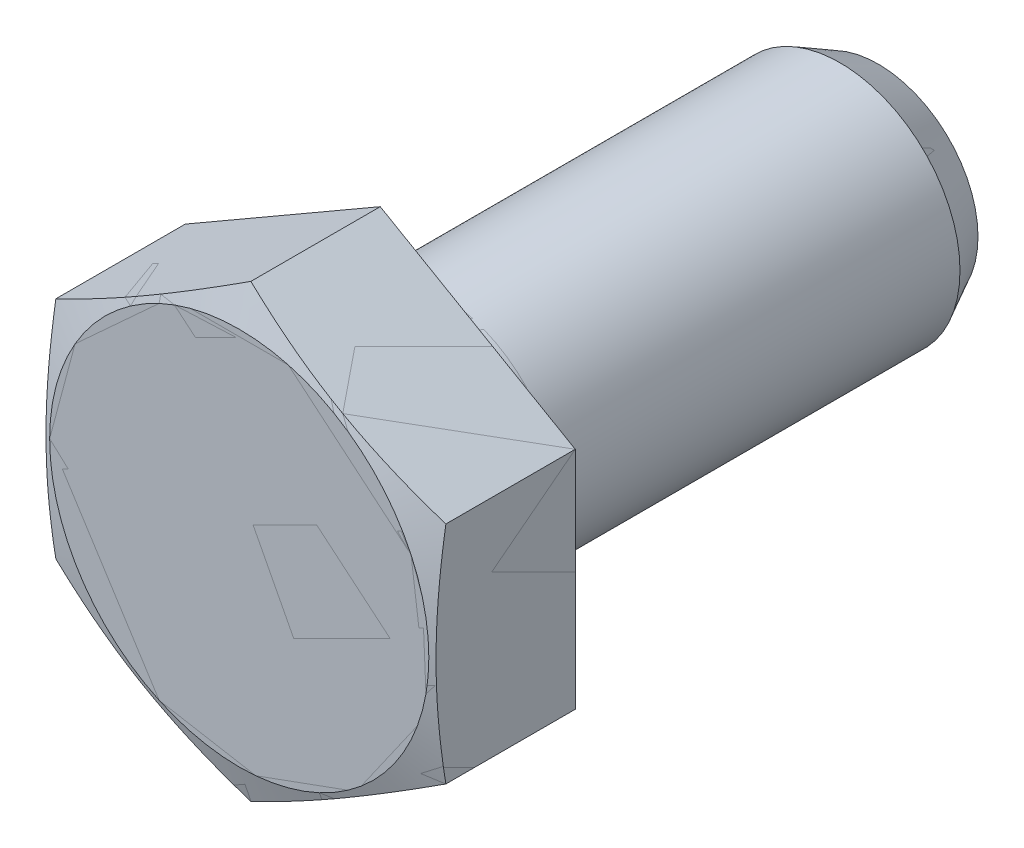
ISO-10303-21;
HEADER;
FILE_DESCRIPTION(('STEP AP214'),'2;1');
FILE_NAME('part.step','',(''),(''),'','','');
FILE_SCHEMA(('AUTOMOTIVE_DESIGN { 1 0 10303 214 1 1 1 1 }'));
ENDSEC;
DATA;
#1=APPLICATION_CONTEXT('core data for automotive mechanical design processes');
#2=APPLICATION_PROTOCOL_DEFINITION('international standard','automotive_design',2000,#1);
#3=PRODUCT_CONTEXT('',#1,'mechanical');
#4=PRODUCT('Part','Part','',(#3));
#5=PRODUCT_RELATED_PRODUCT_CATEGORY('part','',(#4));
#6=PRODUCT_DEFINITION_FORMATION('','',#4);
#7=PRODUCT_DEFINITION_CONTEXT('part definition',#1,'design');
#8=PRODUCT_DEFINITION('design','',#6,#7);
#9=PRODUCT_DEFINITION_SHAPE('','',#8);
#10=(LENGTH_UNIT() NAMED_UNIT(*) SI_UNIT(.MILLI.,.METRE.));
#11=(NAMED_UNIT(*) PLANE_ANGLE_UNIT() SI_UNIT($,.RADIAN.));
#12=(NAMED_UNIT(*) SI_UNIT($,.STERADIAN.) SOLID_ANGLE_UNIT());
#13=UNCERTAINTY_MEASURE_WITH_UNIT(LENGTH_MEASURE(1.E-05),#10,'distance_accuracy_value','');
#14=(GEOMETRIC_REPRESENTATION_CONTEXT(3) GLOBAL_UNCERTAINTY_ASSIGNED_CONTEXT((#13)) GLOBAL_UNIT_ASSIGNED_CONTEXT((#10,
#11,#12)) REPRESENTATION_CONTEXT('',''));
#15=CARTESIAN_POINT('',(0.,0.,0.));
#16=DIRECTION('',(0.,0.,1.));
#17=DIRECTION('',(1.,0.,0.));
#18=AXIS2_PLACEMENT_3D('',#15,#16,#17);
#19=CARTESIAN_POINT('',(0.,0.,0.6));
#20=DIRECTION('',(0.,0.,1.));
#21=DIRECTION('',(1.,0.,0.));
#22=AXIS2_PLACEMENT_3D('',#19,#20,#21);
#23=TOROIDAL_SURFACE('',#22,5.1,0.6);
#24=CARTESIAN_POINT('',(0.,0.,0.6));
#25=DIRECTION('',(0.,0.,1.));
#26=DIRECTION('',(1.,0.,0.));
#27=AXIS2_PLACEMENT_3D('',#24,#25,#26);
#28=CIRCLE('',#27,5.7);
#29=CARTESIAN_POINT('',(5.7,0.,0.6));
#30=VERTEX_POINT('',#29);
#31=EDGE_CURVE('P0_E11',#30,#30,#28,.T.);
#32=ORIENTED_EDGE('',*,*,#31,.F.);
#33=EDGE_LOOP('',(#32));
#34=FACE_BOUND('',#33,.T.);
#35=CARTESIAN_POINT('',(0.,0.,0.));
#36=DIRECTION('',(0.,0.,1.));
#37=DIRECTION('',(1.,0.,0.));
#38=AXIS2_PLACEMENT_3D('',#35,#36,#37);
#39=CIRCLE('',#38,5.1);
#40=CARTESIAN_POINT('',(5.1,0.,0.));
#41=VERTEX_POINT('',#40);
#42=EDGE_CURVE('P0_E33',#41,#41,#39,.T.);
#43=ORIENTED_EDGE('',*,*,#42,.T.);
#44=EDGE_LOOP('',(#43));
#45=FACE_BOUND('',#44,.T.);
#46=ADVANCED_FACE('P0_F26',(#34,#45),#23,.T.);
#47=CARTESIAN_POINT('',(0.,5.1,0.));
#48=DIRECTION('',(0.,0.,-1.));
#49=DIRECTION('',(-1.,0.,0.));
#50=AXIS2_PLACEMENT_3D('',#47,#48,#49);
#51=PLANE('',#50);
#52=CARTESIAN_POINT('',(0.,0.,0.));
#53=DIRECTION('',(0.,0.,1.));
#54=DIRECTION('',(1.,0.,0.));
#55=AXIS2_PLACEMENT_3D('',#52,#53,#54);
#56=CIRCLE('',#55,4.4);
#57=CARTESIAN_POINT('',(4.4,0.,0.));
#58=VERTEX_POINT('',#57);
#59=EDGE_CURVE('P0_E118',#58,#58,#56,.T.);
#60=ORIENTED_EDGE('',*,*,#59,.T.);
#61=EDGE_LOOP('',(#60));
#62=FACE_BOUND('',#61,.T.);
#63=ORIENTED_EDGE('',*,*,#42,.F.);
#64=EDGE_LOOP('',(#63));
#65=FACE_BOUND('',#64,.T.);
#66=ADVANCED_FACE('P0_F124',(#62,#65),#51,.T.);
#67=CARTESIAN_POINT('',(0.,0.,-0.4));
#68=DIRECTION('',(0.,0.,1.));
#69=DIRECTION('',(1.,0.,0.));
#70=AXIS2_PLACEMENT_3D('',#67,#68,#69);
#71=TOROIDAL_SURFACE('',#70,4.4,0.4);
#72=CARTESIAN_POINT('',(0.,0.,-0.4));
#73=DIRECTION('',(0.,0.,1.));
#74=DIRECTION('',(1.,0.,0.));
#75=AXIS2_PLACEMENT_3D('',#72,#73,#74);
#76=CIRCLE('',#75,4.);
#77=CARTESIAN_POINT('',(4.,0.,-0.4));
#78=VERTEX_POINT('',#77);
#79=EDGE_CURVE('P0_E115',#78,#78,#76,.T.);
#80=ORIENTED_EDGE('',*,*,#79,.T.);
#81=EDGE_LOOP('',(#80));
#82=FACE_BOUND('',#81,.T.);
#83=ORIENTED_EDGE('',*,*,#59,.F.);
#84=EDGE_LOOP('',(#83));
#85=FACE_BOUND('',#84,.T.);
#86=ADVANCED_FACE('P0_F126',(#82,#85),#71,.F.);
#87=CARTESIAN_POINT('',(-6.5,-3.752775,0.6));
#88=DIRECTION('',(0.,0.,-1.));
#89=DIRECTION('',(-1.,0.,0.));
#90=AXIS2_PLACEMENT_3D('',#87,#88,#89);
#91=PLANE('',#90);
#92=DIRECTION('',(0.,-1.,0.));
#93=VECTOR('',#92,1.);
#94=CARTESIAN_POINT('',(-6.5,3.752775,0.6));
#95=LINE('',#94,#93);
#96=CARTESIAN_POINT('',(-6.5,3.752775,0.6));
#97=VERTEX_POINT('',#96);
#98=CARTESIAN_POINT('',(-6.5,-3.752775,0.6));
#99=VERTEX_POINT('',#98);
#100=EDGE_CURVE('P0_E92',#97,#99,#95,.T.);
#101=ORIENTED_EDGE('',*,*,#100,.F.);
#102=DIRECTION('',(0.866025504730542,0.499999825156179,0.));
#103=VECTOR('',#102,1.);
#104=CARTESIAN_POINT('',(-6.5,3.752775,0.6));
#105=LINE('',#104,#103);
#106=CARTESIAN_POINT('',(0.,7.50555,0.6));
#107=VERTEX_POINT('',#106);
#108=EDGE_CURVE('P0_E97',#97,#107,#105,.T.);
#109=ORIENTED_EDGE('',*,*,#108,.T.);
#110=DIRECTION('',(0.866025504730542,-0.499999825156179,0.));
#111=VECTOR('',#110,1.);
#112=CARTESIAN_POINT('',(0.,7.50555,0.6));
#113=LINE('',#112,#111);
#114=CARTESIAN_POINT('',(6.5,3.752775,0.6));
#115=VERTEX_POINT('',#114);
#116=EDGE_CURVE('P0_E103',#107,#115,#113,.T.);
#117=ORIENTED_EDGE('',*,*,#116,.T.);
#118=DIRECTION('',(0.,-1.,0.));
#119=VECTOR('',#118,1.);
#120=CARTESIAN_POINT('',(6.5,3.752775,0.6));
#121=LINE('',#120,#119);
#122=CARTESIAN_POINT('',(6.5,-3.752775,0.6));
#123=VERTEX_POINT('',#122);
#124=EDGE_CURVE('P0_E233',#115,#123,#121,.T.);
#125=ORIENTED_EDGE('',*,*,#124,.T.);
#126=DIRECTION('',(-0.866025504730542,-0.499999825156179,0.));
#127=VECTOR('',#126,1.);
#128=CARTESIAN_POINT('',(6.5,-3.752775,0.6));
#129=LINE('',#128,#127);
#130=CARTESIAN_POINT('',(0.,-7.50555,0.6));
#131=VERTEX_POINT('',#130);
#132=EDGE_CURVE('P0_E219',#123,#131,#129,.T.);
#133=ORIENTED_EDGE('',*,*,#132,.T.);
#134=DIRECTION('',(-0.866025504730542,0.499999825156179,0.));
#135=VECTOR('',#134,1.);
#136=CARTESIAN_POINT('',(0.,-7.50555,0.6));
#137=LINE('',#136,#135);
#138=EDGE_CURVE('P0_E217',#131,#99,#137,.T.);
#139=ORIENTED_EDGE('',*,*,#138,.T.);
#140=EDGE_LOOP('',(#101,#109,#117,#125,#133,#139));
#141=FACE_BOUND('',#140,.T.);
#142=ORIENTED_EDGE('',*,*,#31,.T.);
#143=EDGE_LOOP('',(#142));
#144=FACE_BOUND('',#143,.T.);
#145=ADVANCED_FACE('P0_F132',(#141,#144),#91,.T.);
#146=CARTESIAN_POINT('',(-6.5,3.752775,0.6));
#147=DIRECTION('',(-1.,0.,0.));
#148=DIRECTION('',(0.,0.,1.));
#149=AXIS2_PLACEMENT_3D('',#146,#147,#148);
#150=PLANE('',#149);
#151=CARTESIAN_POINT('',(-6.5,-9.92964867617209,3.49086478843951));
#152=CARTESIAN_POINT('',(-6.5,-9.63505499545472,3.5712065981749));
#153=CARTESIAN_POINT('',(-6.5,-9.34019533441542,3.65059082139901));
#154=CARTESIAN_POINT('',(-6.5,-8.74981084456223,3.80691915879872));
#155=CARTESIAN_POINT('',(-6.5,-8.45428597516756,3.88386311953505));
#156=CARTESIAN_POINT('',(-6.5,-7.86204294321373,4.03488590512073));
#157=CARTESIAN_POINT('',(-6.5,-7.56532366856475,4.10896038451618));
#158=CARTESIAN_POINT('',(-6.5,-6.97098572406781,4.2534063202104));
#159=CARTESIAN_POINT('',(-6.5,-6.6733670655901,4.32377782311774));
#160=CARTESIAN_POINT('',(-6.5,-6.08056173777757,4.45911797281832));
#161=CARTESIAN_POINT('',(-6.5,-5.78538736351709,4.52414020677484));
#162=CARTESIAN_POINT('',(-6.5,-5.19386217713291,4.64858264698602));
#163=CARTESIAN_POINT('',(-6.5,-4.89751140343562,4.70800303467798));
#164=CARTESIAN_POINT('',(-6.5,-4.30354427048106,4.81988242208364));
#165=CARTESIAN_POINT('',(-6.5,-4.0059281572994,4.87234271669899));
#166=CARTESIAN_POINT('',(-6.5,-3.40930063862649,4.96872328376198));
#167=CARTESIAN_POINT('',(-6.5,-3.11028923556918,5.01264357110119));
#168=CARTESIAN_POINT('',(-6.5,-2.51225701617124,5.0900277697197));
#169=CARTESIAN_POINT('',(-6.5,-2.21324222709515,5.12353758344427));
#170=CARTESIAN_POINT('',(-6.5,-1.61411183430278,5.17870354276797));
#171=CARTESIAN_POINT('',(-6.5,-1.3139962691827,5.20036010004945));
#172=CARTESIAN_POINT('',(-6.5,-0.713298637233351,5.23053172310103));
#173=CARTESIAN_POINT('',(-6.5,-0.412717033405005,5.23905581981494));
#174=CARTESIAN_POINT('',(-6.5,0.188524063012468,5.24243560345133));
#175=CARTESIAN_POINT('',(-6.5,0.489183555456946,5.2372913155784));
#176=CARTESIAN_POINT('',(-6.5,1.09152745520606,5.2136117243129));
#177=CARTESIAN_POINT('',(-6.5,1.3932090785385,5.19500703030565));
#178=CARTESIAN_POINT('',(-6.5,1.99554958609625,5.14547306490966));
#179=CARTESIAN_POINT('',(-6.5,2.29620843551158,5.11454337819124));
#180=CARTESIAN_POINT('',(-6.5,2.89650581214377,5.0419479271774));
#181=CARTESIAN_POINT('',(-6.5,3.19614304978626,5.00027166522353));
#182=CARTESIAN_POINT('',(-6.5,3.79401781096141,4.90795603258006));
#183=CARTESIAN_POINT('',(-6.5,4.09225532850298,4.85731662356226));
#184=CARTESIAN_POINT('',(-6.5,4.67104479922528,4.75169914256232));
#185=CARTESIAN_POINT('',(-6.5,4.95166879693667,4.69711189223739));
#186=CARTESIAN_POINT('',(-6.5,5.51183010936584,4.58259524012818));
#187=CARTESIAN_POINT('',(-6.5,5.79136737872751,4.52266561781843));
#188=CARTESIAN_POINT('',(-6.5,6.34950884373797,4.39845686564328));
#189=CARTESIAN_POINT('',(-6.5,6.62811290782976,4.3341771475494));
#190=CARTESIAN_POINT('',(-6.5,7.18448228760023,4.20207632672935));
#191=CARTESIAN_POINT('',(-6.5,7.46224758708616,4.13425515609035));
#192=CARTESIAN_POINT('',(-6.5,8.29465040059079,3.92644062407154));
#193=CARTESIAN_POINT('',(-6.5,8.84821091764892,3.78213813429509));
#194=CARTESIAN_POINT('',(-6.5,9.95318059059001,3.48578921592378));
#195=CARTESIAN_POINT('',(-6.5,10.5045899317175,3.33374347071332));
#196=CARTESIAN_POINT('',(-6.5,11.5983000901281,3.02633802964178));
#197=CARTESIAN_POINT('',(-6.5,12.1406218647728,2.87105268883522));
#198=CARTESIAN_POINT('',(-6.5,13.2241662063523,2.5566504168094));
#199=CARTESIAN_POINT('',(-6.5,13.7653887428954,2.39753338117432));
#200=CARTESIAN_POINT('',(-6.5,14.8460115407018,2.07676144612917));
#201=CARTESIAN_POINT('',(-6.5,15.3854133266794,1.91511167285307));
#202=CARTESIAN_POINT('',(-6.5,16.4635332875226,1.58964045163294));
#203=CARTESIAN_POINT('',(-6.5,17.0022514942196,1.42581910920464));
#204=CARTESIAN_POINT('',(-6.5,17.5407314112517,1.26122765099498));
#205=B_SPLINE_CURVE_WITH_KNOTS('',3,(#151,#152,#153,#154,#155,#156,#157,#158,#159,#160,#161,
#162,#163,#164,#165,#166,#167,#168,#169,#170,#171,#172,#173,#174,#175,#176,#177,#178,#179,#180,
#181,#182,#183,#184,#185,#186,#187,#188,#189,#190,#191,#192,#193,#194,#195,#196,#197,#198,#199,
#200,#201,#202,#203,#204),.UNSPECIFIED.,.F.,.F.,(4,2,2,2,2,2,2,2,2,2,2,2,2,2,2,2,2,2,2,2,2,2,2,
2,2,2,4),(0.,0.916063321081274,1.83218412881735,2.74964198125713,3.66708828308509,
4.57379877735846,5.4804798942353,6.38699208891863,7.29350270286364,8.19595761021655,
9.09838117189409,10.0001838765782,10.9019849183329,11.8084683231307,12.7149822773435,
13.6223851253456,14.5297918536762,15.3873818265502,16.2450072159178,17.102748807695,
17.9605068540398,19.676588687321,21.3925193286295,23.0848462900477,24.7772194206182,
26.4665232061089,28.1557452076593),.UNSPECIFIED.);
#206=CARTESIAN_POINT('',(-6.5,3.752775,4.91320410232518));
#207=VERTEX_POINT('',#206);
#208=CARTESIAN_POINT('',(-6.5,-3.752775,4.91320410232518));
#209=VERTEX_POINT('',#208);
#210=EDGE_CURVE('P0_E81',#207,#209,#205,.F.);
#211=ORIENTED_EDGE('',*,*,#210,.F.);
#212=DIRECTION('',(0.,0.,1.));
#213=VECTOR('',#212,1.);
#214=CARTESIAN_POINT('',(-6.5,3.752775,0.6));
#215=LINE('',#214,#213);
#216=EDGE_CURVE('P0_E90',#97,#207,#215,.T.);
#217=ORIENTED_EDGE('',*,*,#216,.F.);
#218=ORIENTED_EDGE('',*,*,#100,.T.);
#219=DIRECTION('',(0.,0.,1.));
#220=VECTOR('',#219,1.);
#221=CARTESIAN_POINT('',(-6.5,-3.752775,0.6));
#222=LINE('',#221,#220);
#223=EDGE_CURVE('P0_E48',#99,#209,#222,.T.);
#224=ORIENTED_EDGE('',*,*,#223,.T.);
#225=EDGE_LOOP('',(#211,#217,#218,#224));
#226=FACE_BOUND('',#225,.T.);
#227=ADVANCED_FACE('P0_F88',(#226),#150,.T.);
#228=CARTESIAN_POINT('',(0.,-7.50555,0.6));
#229=DIRECTION('',(0.499999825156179,0.866025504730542,0.));
#230=DIRECTION('',(0.866025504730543,-0.499999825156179,0.));
#231=AXIS2_PLACEMENT_3D('',#228,#229,#230);
#232=PLANE('',#231);
#233=DIRECTION('',(0.,0.,1.));
#234=VECTOR('',#233,1.);
#235=CARTESIAN_POINT('',(0.,-7.50555,0.6));
#236=LINE('',#235,#234);
#237=CARTESIAN_POINT('',(0.,-7.50555,4.91320495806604));
#238=VERTEX_POINT('',#237);
#239=EDGE_CURVE('P0_E224',#131,#238,#236,.T.);
#240=ORIENTED_EDGE('',*,*,#239,.T.);
#241=CARTESIAN_POINT('',(2.00000000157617E-07,-7.50555011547,4.91320492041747));
#242=CARTESIAN_POINT('',(-0.269500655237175,-7.34995379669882,4.96395435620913));
#243=CARTESIAN_POINT('',(-0.539719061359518,-7.19394319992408,5.01007955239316));
#244=CARTESIAN_POINT('',(-1.08156698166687,-6.88110730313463,5.09118099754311));
#245=CARTESIAN_POINT('',(-1.35319726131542,-6.72428156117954,5.12615037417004));
#246=CARTESIAN_POINT('',(-1.89544179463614,-6.41121667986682,5.1827563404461));
#247=CARTESIAN_POINT('',(-2.16604804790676,-6.25498215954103,5.2044923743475));
#248=CARTESIAN_POINT('',(-2.70776966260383,-5.94221918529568,5.23364290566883));
#249=CARTESIAN_POINT('',(-2.978884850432,-5.78569083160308,5.24106162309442));
#250=CARTESIAN_POINT('',(-3.52111522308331,-5.47263412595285,5.24106153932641));
#251=CARTESIAN_POINT('',(-3.79223040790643,-5.31610577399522,5.23364273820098));
#252=CARTESIAN_POINT('',(-4.33395201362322,-5.00334280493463,5.20449204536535));
#253=CARTESIAN_POINT('',(-4.60455826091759,-4.84710828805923,5.1827559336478));
#254=CARTESIAN_POINT('',(-5.14680278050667,-4.53404341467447,5.12614982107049));
#255=CARTESIAN_POINT('',(-5.41843305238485,-4.3772176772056,5.0911803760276));
#256=CARTESIAN_POINT('',(-5.96028095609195,-4.06438179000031,5.01007880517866));
#257=CARTESIAN_POINT('',(-6.23049935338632,-3.9083711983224,4.96395355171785));
#258=CARTESIAN_POINT('',(-6.5000002,-3.75277488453,4.91320406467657));
#259=B_SPLINE_CURVE_WITH_KNOTS('',3,(#241,#242,#243,#244,#245,#246,#247,#248,#249,#250,#251,
#252,#253,#254,#255,#256,#257,#258),.UNSPECIFIED.,.F.,.F.,(4,2,2,2,2,2,2,2,4),(0.,
0.945987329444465,1.89255629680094,2.83192136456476,3.77100951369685,4.71009765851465,
5.64946272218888,6.59603168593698,7.54201901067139),.UNSPECIFIED.);
#260=EDGE_CURVE('P0_E93',#238,#209,#259,.T.);
#261=ORIENTED_EDGE('',*,*,#260,.T.);
#262=ORIENTED_EDGE('',*,*,#223,.F.);
#263=ORIENTED_EDGE('',*,*,#138,.F.);
#264=EDGE_LOOP('',(#240,#261,#262,#263));
#265=FACE_BOUND('',#264,.T.);
#266=ADVANCED_FACE('P0_F153',(#265),#232,.F.);
#267=CARTESIAN_POINT('',(6.5,-3.752775,0.6));
#268=DIRECTION('',(-0.499999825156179,0.866025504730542,0.));
#269=DIRECTION('',(0.866025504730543,0.499999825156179,0.));
#270=AXIS2_PLACEMENT_3D('',#267,#268,#269);
#271=PLANE('',#270);
#272=DIRECTION('',(0.,0.,1.));
#273=VECTOR('',#272,1.);
#274=CARTESIAN_POINT('',(6.5,-3.752775,0.6));
#275=LINE('',#274,#273);
#276=CARTESIAN_POINT('',(6.5,-3.752775,4.91320410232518));
#277=VERTEX_POINT('',#276);
#278=EDGE_CURVE('P0_E227',#123,#277,#275,.T.);
#279=ORIENTED_EDGE('',*,*,#278,.T.);
#280=CARTESIAN_POINT('',(6.5000002,-3.75277488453,4.91320406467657));
#281=CARTESIAN_POINT('',(6.23049935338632,-3.90837119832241,4.96395355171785));
#282=CARTESIAN_POINT('',(5.96028095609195,-4.06438179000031,5.01007880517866));
#283=CARTESIAN_POINT('',(5.41843305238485,-4.37721767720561,5.0911803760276));
#284=CARTESIAN_POINT('',(5.14680278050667,-4.53404341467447,5.12614982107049));
#285=CARTESIAN_POINT('',(4.60455826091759,-4.84710828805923,5.1827559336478));
#286=CARTESIAN_POINT('',(4.33395201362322,-5.00334280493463,5.20449204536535));
#287=CARTESIAN_POINT('',(3.79223040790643,-5.31610577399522,5.23364273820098));
#288=CARTESIAN_POINT('',(3.52111522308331,-5.47263412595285,5.24106153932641));
#289=CARTESIAN_POINT('',(2.97888485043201,-5.78569083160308,5.24106162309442));
#290=CARTESIAN_POINT('',(2.70776966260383,-5.94221918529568,5.23364290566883));
#291=CARTESIAN_POINT('',(2.16604804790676,-6.25498215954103,5.20449237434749));
#292=CARTESIAN_POINT('',(1.89544179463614,-6.41121667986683,5.1827563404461));
#293=CARTESIAN_POINT('',(1.35319726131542,-6.72428156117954,5.12615037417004));
#294=CARTESIAN_POINT('',(1.08156698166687,-6.88110730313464,5.09118099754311));
#295=CARTESIAN_POINT('',(0.53971906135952,-7.19394319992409,5.01007955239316));
#296=CARTESIAN_POINT('',(0.269500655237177,-7.34995379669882,4.96395435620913));
#297=CARTESIAN_POINT('',(-1.99999999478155E-07,-7.50555011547,4.91320492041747));
#298=B_SPLINE_CURVE_WITH_KNOTS('',3,(#280,#281,#282,#283,#284,#285,#286,#287,#288,#289,#290,
#291,#292,#293,#294,#295,#296,#297),.UNSPECIFIED.,.F.,.F.,(4,2,2,2,2,2,2,2,4),(0.,
0.945987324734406,1.89255628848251,2.83192135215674,3.77100949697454,4.71009764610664,
5.64946271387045,6.59603168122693,7.54201901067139),.UNSPECIFIED.);
#299=EDGE_CURVE('P0_E190',#277,#238,#298,.T.);
#300=ORIENTED_EDGE('',*,*,#299,.T.);
#301=ORIENTED_EDGE('',*,*,#239,.F.);
#302=ORIENTED_EDGE('',*,*,#132,.F.);
#303=EDGE_LOOP('',(#279,#300,#301,#302));
#304=FACE_BOUND('',#303,.T.);
#305=ADVANCED_FACE('P0_F195',(#304),#271,.F.);
#306=CARTESIAN_POINT('',(6.5,3.752775,0.6));
#307=DIRECTION('',(-1.,0.,0.));
#308=DIRECTION('',(0.,0.,1.));
#309=AXIS2_PLACEMENT_3D('',#306,#307,#308);
#310=PLANE('',#309);
#311=DIRECTION('',(0.,0.,1.));
#312=VECTOR('',#311,1.);
#313=CARTESIAN_POINT('',(6.5,3.752775,0.6));
#314=LINE('',#313,#312);
#315=CARTESIAN_POINT('',(6.5,3.752775,4.91320410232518));
#316=VERTEX_POINT('',#315);
#317=EDGE_CURVE('P0_E101',#115,#316,#314,.T.);
#318=ORIENTED_EDGE('',*,*,#317,.T.);
#319=CARTESIAN_POINT('',(6.5,-9.92964867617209,3.49086478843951));
#320=CARTESIAN_POINT('',(6.5,-9.63505499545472,3.5712065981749));
#321=CARTESIAN_POINT('',(6.5,-9.34019533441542,3.65059082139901));
#322=CARTESIAN_POINT('',(6.5,-8.74981084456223,3.80691915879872));
#323=CARTESIAN_POINT('',(6.5,-8.45428597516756,3.88386311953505));
#324=CARTESIAN_POINT('',(6.5,-7.86204294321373,4.03488590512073));
#325=CARTESIAN_POINT('',(6.5,-7.56532366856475,4.10896038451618));
#326=CARTESIAN_POINT('',(6.5,-6.97098572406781,4.2534063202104));
#327=CARTESIAN_POINT('',(6.5,-6.6733670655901,4.32377782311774));
#328=CARTESIAN_POINT('',(6.5,-6.08056173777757,4.45911797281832));
#329=CARTESIAN_POINT('',(6.5,-5.78538736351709,4.52414020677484));
#330=CARTESIAN_POINT('',(6.5,-5.19386217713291,4.64858264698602));
#331=CARTESIAN_POINT('',(6.5,-4.89751140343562,4.70800303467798));
#332=CARTESIAN_POINT('',(6.5,-4.30354427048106,4.81988242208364));
#333=CARTESIAN_POINT('',(6.5,-4.00592815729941,4.87234271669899));
#334=CARTESIAN_POINT('',(6.5,-3.40930063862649,4.96872328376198));
#335=CARTESIAN_POINT('',(6.5,-3.11028923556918,5.01264357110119));
#336=CARTESIAN_POINT('',(6.5,-2.51225701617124,5.0900277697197));
#337=CARTESIAN_POINT('',(6.5,-2.21324222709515,5.12353758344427));
#338=CARTESIAN_POINT('',(6.5,-1.61411183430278,5.17870354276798));
#339=CARTESIAN_POINT('',(6.5,-1.3139962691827,5.20036010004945));
#340=CARTESIAN_POINT('',(6.5,-0.713298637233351,5.23053172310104));
#341=CARTESIAN_POINT('',(6.5,-0.412717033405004,5.23905581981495));
#342=CARTESIAN_POINT('',(6.5,0.188524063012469,5.24243560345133));
#343=CARTESIAN_POINT('',(6.5,0.489183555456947,5.2372913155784));
#344=CARTESIAN_POINT('',(6.5,1.09152745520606,5.2136117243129));
#345=CARTESIAN_POINT('',(6.5,1.3932090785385,5.19500703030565));
#346=CARTESIAN_POINT('',(6.5,1.99554958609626,5.14547306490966));
#347=CARTESIAN_POINT('',(6.5,2.29620843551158,5.11454337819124));
#348=CARTESIAN_POINT('',(6.5,2.89650581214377,5.0419479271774));
#349=CARTESIAN_POINT('',(6.5,3.19614304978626,5.00027166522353));
#350=CARTESIAN_POINT('',(6.5,3.79401781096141,4.90795603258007));
#351=CARTESIAN_POINT('',(6.5,4.09225532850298,4.85731662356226));
#352=CARTESIAN_POINT('',(6.5,4.67104479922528,4.75169914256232));
#353=CARTESIAN_POINT('',(6.5,4.95166879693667,4.69711189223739));
#354=CARTESIAN_POINT('',(6.5,5.51183010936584,4.58259524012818));
#355=CARTESIAN_POINT('',(6.5,5.79136737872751,4.52266561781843));
#356=CARTESIAN_POINT('',(6.5,6.34950884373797,4.39845686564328));
#357=CARTESIAN_POINT('',(6.5,6.62811290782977,4.3341771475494));
#358=CARTESIAN_POINT('',(6.5,7.18448228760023,4.20207632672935));
#359=CARTESIAN_POINT('',(6.5,7.46224758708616,4.13425515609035));
#360=CARTESIAN_POINT('',(6.5,8.29465040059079,3.92644062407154));
#361=CARTESIAN_POINT('',(6.5,8.84821091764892,3.78213813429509));
#362=CARTESIAN_POINT('',(6.5,9.95318059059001,3.48578921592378));
#363=CARTESIAN_POINT('',(6.5,10.5045899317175,3.33374347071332));
#364=CARTESIAN_POINT('',(6.5,11.5983000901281,3.02633802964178));
#365=CARTESIAN_POINT('',(6.5,12.1406218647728,2.87105268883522));
#366=CARTESIAN_POINT('',(6.5,13.2241662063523,2.5566504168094));
#367=CARTESIAN_POINT('',(6.5,13.7653887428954,2.39753338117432));
#368=CARTESIAN_POINT('',(6.5,14.8460115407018,2.07676144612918));
#369=CARTESIAN_POINT('',(6.5,15.3854133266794,1.91511167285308));
#370=CARTESIAN_POINT('',(6.5,16.4635332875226,1.58964045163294));
#371=CARTESIAN_POINT('',(6.5,17.0022514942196,1.42581910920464));
#372=CARTESIAN_POINT('',(6.5,17.5407314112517,1.26122765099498));
#373=B_SPLINE_CURVE_WITH_KNOTS('',3,(#319,#320,#321,#322,#323,#324,#325,#326,#327,#328,#329,
#330,#331,#332,#333,#334,#335,#336,#337,#338,#339,#340,#341,#342,#343,#344,#345,#346,#347,#348,
#349,#350,#351,#352,#353,#354,#355,#356,#357,#358,#359,#360,#361,#362,#363,#364,#365,#366,#367,
#368,#369,#370,#371,#372),.UNSPECIFIED.,.F.,.F.,(4,2,2,2,2,2,2,2,2,2,2,2,2,2,2,2,2,2,2,2,2,2,2,
2,2,2,4),(0.,0.916063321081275,1.83218412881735,2.74964198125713,3.66708828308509,
4.57379877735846,5.4804798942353,6.38699208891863,7.29350270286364,8.19595761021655,
9.09838117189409,10.0001838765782,10.9019849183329,11.8084683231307,12.7149822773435,
13.6223851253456,14.5297918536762,15.3873818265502,16.2450072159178,17.102748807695,
17.9605068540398,19.676588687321,21.3925193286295,23.0848462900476,24.7772194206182,
26.4665232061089,28.1557452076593),.UNSPECIFIED.);
#374=EDGE_CURVE('P0_E185',#316,#277,#373,.F.);
#375=ORIENTED_EDGE('',*,*,#374,.T.);
#376=ORIENTED_EDGE('',*,*,#278,.F.);
#377=ORIENTED_EDGE('',*,*,#124,.F.);
#378=EDGE_LOOP('',(#318,#375,#376,#377));
#379=FACE_BOUND('',#378,.T.);
#380=ADVANCED_FACE('P0_F198',(#379),#310,.F.);
#381=CARTESIAN_POINT('',(0.,7.50555,0.6));
#382=DIRECTION('',(-0.499999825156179,-0.866025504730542,0.));
#383=DIRECTION('',(-0.866025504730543,0.499999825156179,0.));
#384=AXIS2_PLACEMENT_3D('',#381,#382,#383);
#385=PLANE('',#384);
#386=DIRECTION('',(0.,0.,1.));
#387=VECTOR('',#386,1.);
#388=CARTESIAN_POINT('',(0.,7.50555,0.6));
#389=LINE('',#388,#387);
#390=CARTESIAN_POINT('',(0.,7.50555,4.91320495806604));
#391=VERTEX_POINT('',#390);
#392=EDGE_CURVE('P0_E99',#107,#391,#389,.T.);
#393=ORIENTED_EDGE('',*,*,#392,.T.);
#394=CARTESIAN_POINT('',(-1.9999999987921E-07,7.50555011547,4.91320492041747));
#395=CARTESIAN_POINT('',(0.269500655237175,7.34995379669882,4.96395435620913));
#396=CARTESIAN_POINT('',(0.539719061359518,7.19394319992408,5.01007955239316));
#397=CARTESIAN_POINT('',(1.08156698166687,6.88110730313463,5.09118099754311));
#398=CARTESIAN_POINT('',(1.35319726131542,6.72428156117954,5.12615037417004));
#399=CARTESIAN_POINT('',(1.89544179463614,6.41121667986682,5.1827563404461));
#400=CARTESIAN_POINT('',(2.16604804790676,6.25498215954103,5.2044923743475));
#401=CARTESIAN_POINT('',(2.70776966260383,5.94221918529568,5.23364290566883));
#402=CARTESIAN_POINT('',(2.978884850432,5.78569083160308,5.24106162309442));
#403=CARTESIAN_POINT('',(3.52111522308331,5.47263412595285,5.24106153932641));
#404=CARTESIAN_POINT('',(3.79223040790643,5.31610577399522,5.23364273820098));
#405=CARTESIAN_POINT('',(4.33395201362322,5.00334280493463,5.20449204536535));
#406=CARTESIAN_POINT('',(4.60455826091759,4.84710828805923,5.1827559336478));
#407=CARTESIAN_POINT('',(5.14680278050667,4.53404341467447,5.12614982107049));
#408=CARTESIAN_POINT('',(5.41843305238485,4.3772176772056,5.0911803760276));
#409=CARTESIAN_POINT('',(5.96028095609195,4.06438179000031,5.01007880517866));
#410=CARTESIAN_POINT('',(6.23049935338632,3.9083711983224,4.96395355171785));
#411=CARTESIAN_POINT('',(6.5000002,3.75277488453,4.91320406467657));
#412=B_SPLINE_CURVE_WITH_KNOTS('',3,(#394,#395,#396,#397,#398,#399,#400,#401,#402,#403,#404,
#405,#406,#407,#408,#409,#410,#411),.UNSPECIFIED.,.F.,.F.,(4,2,2,2,2,2,2,2,4),(0.,
0.945987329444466,1.89255629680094,2.83192136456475,3.77100951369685,4.71009765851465,
5.64946272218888,6.59603168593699,7.54201901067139),.UNSPECIFIED.);
#413=EDGE_CURVE('P0_E40',#391,#316,#412,.T.);
#414=ORIENTED_EDGE('',*,*,#413,.T.);
#415=ORIENTED_EDGE('',*,*,#317,.F.);
#416=ORIENTED_EDGE('',*,*,#116,.F.);
#417=EDGE_LOOP('',(#393,#414,#415,#416));
#418=FACE_BOUND('',#417,.T.);
#419=ADVANCED_FACE('P0_F202',(#418),#385,.F.);
#420=CARTESIAN_POINT('',(-6.5,3.752775,0.6));
#421=DIRECTION('',(0.499999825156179,-0.866025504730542,0.));
#422=DIRECTION('',(-0.866025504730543,-0.499999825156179,0.));
#423=AXIS2_PLACEMENT_3D('',#420,#421,#422);
#424=PLANE('',#423);
#425=ORIENTED_EDGE('',*,*,#216,.T.);
#426=CARTESIAN_POINT('',(-6.5000002,3.75277488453,4.91320406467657));
#427=CARTESIAN_POINT('',(-6.23049935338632,3.90837119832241,4.96395355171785));
#428=CARTESIAN_POINT('',(-5.96028095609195,4.06438179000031,5.01007880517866));
#429=CARTESIAN_POINT('',(-5.41843305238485,4.37721767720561,5.0911803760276));
#430=CARTESIAN_POINT('',(-5.14680278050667,4.53404341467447,5.12614982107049));
#431=CARTESIAN_POINT('',(-4.60455826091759,4.84710828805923,5.1827559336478));
#432=CARTESIAN_POINT('',(-4.33395201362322,5.00334280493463,5.20449204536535));
#433=CARTESIAN_POINT('',(-3.79223040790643,5.31610577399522,5.23364273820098));
#434=CARTESIAN_POINT('',(-3.52111522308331,5.47263412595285,5.24106153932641));
#435=CARTESIAN_POINT('',(-2.97888485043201,5.78569083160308,5.24106162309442));
#436=CARTESIAN_POINT('',(-2.70776966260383,5.94221918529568,5.23364290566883));
#437=CARTESIAN_POINT('',(-2.16604804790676,6.25498215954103,5.20449237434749));
#438=CARTESIAN_POINT('',(-1.89544179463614,6.41121667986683,5.1827563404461));
#439=CARTESIAN_POINT('',(-1.35319726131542,6.72428156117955,5.12615037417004));
#440=CARTESIAN_POINT('',(-1.08156698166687,6.88110730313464,5.09118099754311));
#441=CARTESIAN_POINT('',(-0.53971906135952,7.19394319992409,5.01007955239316));
#442=CARTESIAN_POINT('',(-0.269500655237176,7.34995379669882,4.96395435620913));
#443=CARTESIAN_POINT('',(2.00000000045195E-07,7.50555011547,4.91320492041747));
#444=B_SPLINE_CURVE_WITH_KNOTS('',3,(#426,#427,#428,#429,#430,#431,#432,#433,#434,#435,#436,
#437,#438,#439,#440,#441,#442,#443),.UNSPECIFIED.,.F.,.F.,(4,2,2,2,2,2,2,2,4),(0.,
0.945987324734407,1.89255628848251,2.83192135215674,3.77100949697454,4.71009764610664,
5.64946271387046,6.59603168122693,7.54201901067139),.UNSPECIFIED.);
#445=EDGE_CURVE('P0_E77',#207,#391,#444,.T.);
#446=ORIENTED_EDGE('',*,*,#445,.T.);
#447=ORIENTED_EDGE('',*,*,#392,.F.);
#448=ORIENTED_EDGE('',*,*,#108,.F.);
#449=EDGE_LOOP('',(#425,#446,#447,#448));
#450=FACE_BOUND('',#449,.T.);
#451=ADVANCED_FACE('P0_F95',(#450),#424,.F.);
#452=CARTESIAN_POINT('',(0.,0.,4.86426181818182));
#453=DIRECTION('',(0.,0.,-1.));
#454=DIRECTION('',(-1.,0.,0.));
#455=AXIS2_PLACEMENT_3D('',#452,#453,#454);
#456=CONICAL_SURFACE('',#455,7.655661,1.25561835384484);
#457=ORIENTED_EDGE('',*,*,#210,.T.);
#458=ORIENTED_EDGE('',*,*,#260,.F.);
#459=ORIENTED_EDGE('',*,*,#299,.F.);
#460=ORIENTED_EDGE('',*,*,#374,.F.);
#461=ORIENTED_EDGE('',*,*,#413,.F.);
#462=ORIENTED_EDGE('',*,*,#445,.F.);
#463=EDGE_LOOP('',(#457,#458,#459,#460,#461,#462));
#464=FACE_BOUND('',#463,.T.);
#465=CARTESIAN_POINT('',(0.,0.,5.3));
#466=DIRECTION('',(0.,0.,-1.));
#467=DIRECTION('',(-1.,0.,0.));
#468=AXIS2_PLACEMENT_3D('',#465,#466,#467);
#469=CIRCLE('',#468,6.319230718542);
#470=CARTESIAN_POINT('',(-6.319230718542,0.,5.3));
#471=VERTEX_POINT('',#470);
#472=EDGE_CURVE('P0_E85',#471,#471,#469,.F.);
#473=ORIENTED_EDGE('',*,*,#472,.F.);
#474=EDGE_LOOP('',(#473));
#475=FACE_BOUND('',#474,.T.);
#476=ADVANCED_FACE('P0_F79',(#464,#475),#456,.T.);
#477=CARTESIAN_POINT('',(-6.5,-3.752775,5.3));
#478=DIRECTION('',(0.,0.,-1.));
#479=DIRECTION('',(-1.,0.,0.));
#480=AXIS2_PLACEMENT_3D('',#477,#478,#479);
#481=PLANE('',#480);
#482=ORIENTED_EDGE('',*,*,#472,.T.);
#483=EDGE_LOOP('',(#482));
#484=FACE_BOUND('',#483,.T.);
#485=ADVANCED_FACE('P0_F148',(#484),#481,.F.);
#486=CARTESIAN_POINT('',(0.,3.3234375,-16.));
#487=DIRECTION('',(0.,0.,-1.));
#488=DIRECTION('',(-1.,0.,0.));
#489=AXIS2_PLACEMENT_3D('',#486,#487,#488);
#490=PLANE('',#489);
#491=CARTESIAN_POINT('',(0.,0.,-16.));
#492=DIRECTION('',(0.,0.,1.));
#493=DIRECTION('',(1.,0.,0.));
#494=AXIS2_PLACEMENT_3D('',#491,#492,#493);
#495=CIRCLE('',#494,3.3234375);
#496=CARTESIAN_POINT('',(3.3234375,0.,-16.));
#497=VERTEX_POINT('',#496);
#498=EDGE_CURVE('P0_E109',#497,#497,#495,.T.);
#499=ORIENTED_EDGE('',*,*,#498,.F.);
#500=EDGE_LOOP('',(#499));
#501=FACE_BOUND('',#500,.T.);
#502=ADVANCED_FACE('P0_F144',(#501),#490,.T.);
#503=CARTESIAN_POINT('',(0.,0.,-14.7234375));
#504=DIRECTION('',(0.,0.,1.));
#505=DIRECTION('',(1.,0.,0.));
#506=AXIS2_PLACEMENT_3D('',#503,#504,#505);
#507=CONICAL_SURFACE('',#506,4.,0.487349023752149);
#508=ORIENTED_EDGE('',*,*,#498,.T.);
#509=EDGE_LOOP('',(#508));
#510=FACE_BOUND('',#509,.T.);
#511=CARTESIAN_POINT('',(0.,0.,-14.7234375));
#512=DIRECTION('',(0.,0.,1.));
#513=DIRECTION('',(1.,0.,0.));
#514=AXIS2_PLACEMENT_3D('',#511,#512,#513);
#515=CIRCLE('',#514,4.);
#516=CARTESIAN_POINT('',(4.,0.,-14.7234375));
#517=VERTEX_POINT('',#516);
#518=EDGE_CURVE('P0_E112',#517,#517,#515,.T.);
#519=ORIENTED_EDGE('',*,*,#518,.F.);
#520=EDGE_LOOP('',(#519));
#521=FACE_BOUND('',#520,.T.);
#522=ADVANCED_FACE('P0_F140',(#510,#521),#507,.T.);
#523=CARTESIAN_POINT('',(0.,0.,0.6));
#524=DIRECTION('',(0.,0.,1.));
#525=DIRECTION('',(1.,0.,0.));
#526=AXIS2_PLACEMENT_3D('',#523,#524,#525);
#527=CYLINDRICAL_SURFACE('',#526,4.);
#528=ORIENTED_EDGE('',*,*,#518,.T.);
#529=EDGE_LOOP('',(#528));
#530=FACE_BOUND('',#529,.T.);
#531=ORIENTED_EDGE('',*,*,#79,.F.);
#532=EDGE_LOOP('',(#531));
#533=FACE_BOUND('',#532,.T.);
#534=ADVANCED_FACE('P0_F137',(#530,#533),#527,.T.);
#535=CLOSED_SHELL('',(#46,#66,#86,#145,#227,#266,#305,#380,#419,#451,#476,#485,#502,#522,#534));
#536=MANIFOLD_SOLID_BREP('P0_B2',#535);
#537=CARTESIAN_POINT('',(0.,0.,0.6));
#538=DIRECTION('',(0.,0.,1.));
#539=DIRECTION('',(1.,0.,0.));
#540=AXIS2_PLACEMENT_3D('',#537,#538,#539);
#541=TOROIDAL_SURFACE('',#540,5.1,0.6);
#542=CARTESIAN_POINT('',(0.,0.,0.6));
#543=DIRECTION('',(0.,0.,1.));
#544=DIRECTION('',(1.,0.,0.));
#545=AXIS2_PLACEMENT_3D('',#542,#543,#544);
#546=CIRCLE('',#545,5.7);
#547=CARTESIAN_POINT('',(5.7,0.,0.6));
#548=VERTEX_POINT('',#547);
#549=EDGE_CURVE('P1_E11',#548,#548,#546,.T.);
#550=ORIENTED_EDGE('',*,*,#549,.F.);
#551=EDGE_LOOP('',(#550));
#552=FACE_BOUND('',#551,.T.);
#553=CARTESIAN_POINT('',(0.,0.,0.));
#554=DIRECTION('',(0.,0.,1.));
#555=DIRECTION('',(1.,0.,0.));
#556=AXIS2_PLACEMENT_3D('',#553,#554,#555);
#557=CIRCLE('',#556,5.1);
#558=CARTESIAN_POINT('',(5.1,0.,0.));
#559=VERTEX_POINT('',#558);
#560=EDGE_CURVE('P1_E23',#559,#559,#557,.T.);
#561=ORIENTED_EDGE('',*,*,#560,.T.);
#562=EDGE_LOOP('',(#561));
#563=FACE_BOUND('',#562,.T.);
#564=ADVANCED_FACE('P1_F16',(#552,#563),#541,.T.);
#565=CARTESIAN_POINT('',(0.,5.1,0.));
#566=DIRECTION('',(0.,0.,-1.));
#567=DIRECTION('',(-1.,0.,0.));
#568=AXIS2_PLACEMENT_3D('',#565,#566,#567);
#569=PLANE('',#568);
#570=CARTESIAN_POINT('',(0.,0.,0.));
#571=DIRECTION('',(0.,0.,1.));
#572=DIRECTION('',(1.,0.,0.));
#573=AXIS2_PLACEMENT_3D('',#570,#571,#572);
#574=CIRCLE('',#573,4.4);
#575=CARTESIAN_POINT('',(4.4,0.,0.));
#576=VERTEX_POINT('',#575);
#577=EDGE_CURVE('P1_E117',#576,#576,#574,.T.);
#578=ORIENTED_EDGE('',*,*,#577,.T.);
#579=EDGE_LOOP('',(#578));
#580=FACE_BOUND('',#579,.T.);
#581=ORIENTED_EDGE('',*,*,#560,.F.);
#582=EDGE_LOOP('',(#581));
#583=FACE_BOUND('',#582,.T.);
#584=ADVANCED_FACE('P1_F123',(#580,#583),#569,.T.);
#585=CARTESIAN_POINT('',(0.,0.,-0.4));
#586=DIRECTION('',(0.,0.,1.));
#587=DIRECTION('',(1.,0.,0.));
#588=AXIS2_PLACEMENT_3D('',#585,#586,#587);
#589=TOROIDAL_SURFACE('',#588,4.4,0.4);
#590=CARTESIAN_POINT('',(0.,0.,-0.4));
#591=DIRECTION('',(0.,0.,1.));
#592=DIRECTION('',(1.,0.,0.));
#593=AXIS2_PLACEMENT_3D('',#590,#591,#592);
#594=CIRCLE('',#593,4.);
#595=CARTESIAN_POINT('',(4.,0.,-0.4));
#596=VERTEX_POINT('',#595);
#597=EDGE_CURVE('P1_E114',#596,#596,#594,.T.);
#598=ORIENTED_EDGE('',*,*,#597,.T.);
#599=EDGE_LOOP('',(#598));
#600=FACE_BOUND('',#599,.T.);
#601=ORIENTED_EDGE('',*,*,#577,.F.);
#602=EDGE_LOOP('',(#601));
#603=FACE_BOUND('',#602,.T.);
#604=ADVANCED_FACE('P1_F125',(#600,#603),#589,.F.);
#605=CARTESIAN_POINT('',(0.,0.,0.6));
#606=DIRECTION('',(0.,0.,1.));
#607=DIRECTION('',(1.,0.,0.));
#608=AXIS2_PLACEMENT_3D('',#605,#606,#607);
#609=CYLINDRICAL_SURFACE('',#608,4.);
#610=CARTESIAN_POINT('',(0.,0.,-1.37215937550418));
#611=DIRECTION('',(0.,0.,1.));
#612=DIRECTION('',(1.,0.,0.));
#613=AXIS2_PLACEMENT_3D('',#610,#611,#612);
#614=CIRCLE('',#613,4.);
#615=CARTESIAN_POINT('',(4.,0.,-1.37215937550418));
#616=VERTEX_POINT('',#615);
#617=EDGE_CURVE('P1_E111',#616,#616,#614,.T.);
#618=ORIENTED_EDGE('',*,*,#617,.T.);
#619=EDGE_LOOP('',(#618));
#620=FACE_BOUND('',#619,.T.);
#621=ORIENTED_EDGE('',*,*,#597,.F.);
#622=EDGE_LOOP('',(#621));
#623=FACE_BOUND('',#622,.T.);
#624=ADVANCED_FACE('P1_F132',(#620,#623),#609,.T.);
#625=CARTESIAN_POINT('',(0.,0.,-1.37215937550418));
#626=DIRECTION('',(0.,0.,1.));
#627=DIRECTION('',(1.,0.,0.));
#628=AXIS2_PLACEMENT_3D('',#625,#626,#627);
#629=CONICAL_SURFACE('',#628,4.,0.523598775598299);
#630=CARTESIAN_POINT('',(0.,0.,-2.544));
#631=DIRECTION('',(0.,0.,1.));
#632=DIRECTION('',(1.,0.,0.));
#633=AXIS2_PLACEMENT_3D('',#630,#631,#632);
#634=CIRCLE('',#633,3.3234375);
#635=CARTESIAN_POINT('',(3.3234375,0.,-2.544));
#636=VERTEX_POINT('',#635);
#637=EDGE_CURVE('P1_E108',#636,#636,#634,.T.);
#638=ORIENTED_EDGE('',*,*,#637,.T.);
#639=EDGE_LOOP('',(#638));
#640=FACE_BOUND('',#639,.T.);
#641=ORIENTED_EDGE('',*,*,#617,.F.);
#642=EDGE_LOOP('',(#641));
#643=FACE_BOUND('',#642,.T.);
#644=ADVANCED_FACE('P1_F139',(#640,#643),#629,.T.);
#645=CARTESIAN_POINT('',(0.,3.3234375,-2.544));
#646=DIRECTION('',(0.,0.,1.));
#647=DIRECTION('',(1.,0.,0.));
#648=AXIS2_PLACEMENT_3D('',#645,#646,#647);
#649=PLANE('',#648);
#650=CARTESIAN_POINT('',(0.,0.,-2.544));
#651=DIRECTION('',(0.,0.,1.));
#652=DIRECTION('',(1.,0.,0.));
#653=AXIS2_PLACEMENT_3D('',#650,#651,#652);
#654=CIRCLE('',#653,4.);
#655=CARTESIAN_POINT('',(4.,0.,-2.544));
#656=VERTEX_POINT('',#655);
#657=EDGE_CURVE('P1_E105',#656,#656,#654,.T.);
#658=ORIENTED_EDGE('',*,*,#657,.T.);
#659=EDGE_LOOP('',(#658));
#660=FACE_BOUND('',#659,.T.);
#661=ORIENTED_EDGE('',*,*,#637,.F.);
#662=EDGE_LOOP('',(#661));
#663=FACE_BOUND('',#662,.T.);
#664=ADVANCED_FACE('P1_F143',(#660,#663),#649,.T.);
#665=CARTESIAN_POINT('',(0.,0.,0.6));
#666=DIRECTION('',(0.,0.,1.));
#667=DIRECTION('',(1.,0.,0.));
#668=AXIS2_PLACEMENT_3D('',#665,#666,#667);
#669=CYLINDRICAL_SURFACE('',#668,4.);
#670=CARTESIAN_POINT('',(0.,0.,-14.7234375));
#671=DIRECTION('',(0.,0.,1.));
#672=DIRECTION('',(1.,0.,0.));
#673=AXIS2_PLACEMENT_3D('',#670,#671,#672);
#674=CIRCLE('',#673,4.);
#675=CARTESIAN_POINT('',(4.,0.,-14.7234375));
#676=VERTEX_POINT('',#675);
#677=EDGE_CURVE('P1_E102',#676,#676,#674,.T.);
#678=ORIENTED_EDGE('',*,*,#677,.T.);
#679=EDGE_LOOP('',(#678));
#680=FACE_BOUND('',#679,.T.);
#681=ORIENTED_EDGE('',*,*,#657,.F.);
#682=EDGE_LOOP('',(#681));
#683=FACE_BOUND('',#682,.T.);
#684=ADVANCED_FACE('P1_F147',(#680,#683),#669,.T.);
#685=CARTESIAN_POINT('',(0.,0.,-14.7234375));
#686=DIRECTION('',(0.,0.,1.));
#687=DIRECTION('',(1.,0.,0.));
#688=AXIS2_PLACEMENT_3D('',#685,#686,#687);
#689=CONICAL_SURFACE('',#688,4.,0.487349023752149);
#690=CARTESIAN_POINT('',(0.,0.,-16.));
#691=DIRECTION('',(0.,0.,1.));
#692=DIRECTION('',(1.,0.,0.));
#693=AXIS2_PLACEMENT_3D('',#690,#691,#692);
#694=CIRCLE('',#693,3.3234375);
#695=CARTESIAN_POINT('',(3.3234375,0.,-16.));
#696=VERTEX_POINT('',#695);
#697=EDGE_CURVE('P1_E99',#696,#696,#694,.T.);
#698=ORIENTED_EDGE('',*,*,#697,.T.);
#699=EDGE_LOOP('',(#698));
#700=FACE_BOUND('',#699,.T.);
#701=ORIENTED_EDGE('',*,*,#677,.F.);
#702=EDGE_LOOP('',(#701));
#703=FACE_BOUND('',#702,.T.);
#704=ADVANCED_FACE('P1_F151',(#700,#703),#689,.T.);
#705=CARTESIAN_POINT('',(0.,3.3234375,-16.));
#706=DIRECTION('',(0.,0.,-1.));
#707=DIRECTION('',(-1.,0.,0.));
#708=AXIS2_PLACEMENT_3D('',#705,#706,#707);
#709=PLANE('',#708);
#710=ORIENTED_EDGE('',*,*,#697,.F.);
#711=EDGE_LOOP('',(#710));
#712=FACE_BOUND('',#711,.T.);
#713=ADVANCED_FACE('P1_F155',(#712),#709,.T.);
#714=CARTESIAN_POINT('',(-6.5,-3.752775,0.6));
#715=DIRECTION('',(0.,0.,-1.));
#716=DIRECTION('',(-1.,0.,0.));
#717=AXIS2_PLACEMENT_3D('',#714,#715,#716);
#718=PLANE('',#717);
#719=DIRECTION('',(0.,-1.,0.));
#720=VECTOR('',#719,1.);
#721=CARTESIAN_POINT('',(-6.5,3.752775,0.6));
#722=LINE('',#721,#720);
#723=CARTESIAN_POINT('',(-6.5,3.752775,0.6));
#724=VERTEX_POINT('',#723);
#725=CARTESIAN_POINT('',(-6.5,-3.752775,0.6));
#726=VERTEX_POINT('',#725);
#727=EDGE_CURVE('P1_E82',#724,#726,#722,.T.);
#728=ORIENTED_EDGE('',*,*,#727,.F.);
#729=DIRECTION('',(0.866025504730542,0.499999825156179,0.));
#730=VECTOR('',#729,1.);
#731=CARTESIAN_POINT('',(-6.5,3.752775,0.6));
#732=LINE('',#731,#730);
#733=CARTESIAN_POINT('',(0.,7.50555,0.6));
#734=VERTEX_POINT('',#733);
#735=EDGE_CURVE('P1_E87',#724,#734,#732,.T.);
#736=ORIENTED_EDGE('',*,*,#735,.T.);
#737=DIRECTION('',(0.866025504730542,-0.499999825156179,0.));
#738=VECTOR('',#737,1.);
#739=CARTESIAN_POINT('',(0.,7.50555,0.6));
#740=LINE('',#739,#738);
#741=CARTESIAN_POINT('',(6.5,3.752775,0.6));
#742=VERTEX_POINT('',#741);
#743=EDGE_CURVE('P1_E93',#734,#742,#740,.T.);
#744=ORIENTED_EDGE('',*,*,#743,.T.);
#745=DIRECTION('',(0.,-1.,0.));
#746=VECTOR('',#745,1.);
#747=CARTESIAN_POINT('',(6.5,3.752775,0.6));
#748=LINE('',#747,#746);
#749=CARTESIAN_POINT('',(6.5,-3.752775,0.6));
#750=VERTEX_POINT('',#749);
#751=EDGE_CURVE('P1_E245',#742,#750,#748,.T.);
#752=ORIENTED_EDGE('',*,*,#751,.T.);
#753=DIRECTION('',(-0.866025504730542,-0.499999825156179,0.));
#754=VECTOR('',#753,1.);
#755=CARTESIAN_POINT('',(6.5,-3.752775,0.6));
#756=LINE('',#755,#754);
#757=CARTESIAN_POINT('',(0.,-7.50555,0.6));
#758=VERTEX_POINT('',#757);
#759=EDGE_CURVE('P1_E231',#750,#758,#756,.T.);
#760=ORIENTED_EDGE('',*,*,#759,.T.);
#761=DIRECTION('',(-0.866025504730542,0.499999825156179,0.));
#762=VECTOR('',#761,1.);
#763=CARTESIAN_POINT('',(0.,-7.50555,0.6));
#764=LINE('',#763,#762);
#765=EDGE_CURVE('P1_E229',#758,#726,#764,.T.);
#766=ORIENTED_EDGE('',*,*,#765,.T.);
#767=EDGE_LOOP('',(#728,#736,#744,#752,#760,#766));
#768=FACE_BOUND('',#767,.T.);
#769=ORIENTED_EDGE('',*,*,#549,.T.);
#770=EDGE_LOOP('',(#769));
#771=FACE_BOUND('',#770,.T.);
#772=ADVANCED_FACE('P1_F159',(#768,#771),#718,.T.);
#773=CARTESIAN_POINT('',(-6.5,3.752775,0.6));
#774=DIRECTION('',(-1.,0.,0.));
#775=DIRECTION('',(0.,0.,1.));
#776=AXIS2_PLACEMENT_3D('',#773,#774,#775);
#777=PLANE('',#776);
#778=CARTESIAN_POINT('',(-6.5,-9.92964867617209,3.49086478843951));
#779=CARTESIAN_POINT('',(-6.5,-9.63505499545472,3.5712065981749));
#780=CARTESIAN_POINT('',(-6.5,-9.34019533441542,3.65059082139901));
#781=CARTESIAN_POINT('',(-6.5,-8.74981084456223,3.80691915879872));
#782=CARTESIAN_POINT('',(-6.5,-8.45428597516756,3.88386311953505));
#783=CARTESIAN_POINT('',(-6.5,-7.86204294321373,4.03488590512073));
#784=CARTESIAN_POINT('',(-6.5,-7.56532366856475,4.10896038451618));
#785=CARTESIAN_POINT('',(-6.5,-6.97098572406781,4.2534063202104));
#786=CARTESIAN_POINT('',(-6.5,-6.6733670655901,4.32377782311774));
#787=CARTESIAN_POINT('',(-6.5,-6.08056173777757,4.45911797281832));
#788=CARTESIAN_POINT('',(-6.5,-5.78538736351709,4.52414020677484));
#789=CARTESIAN_POINT('',(-6.5,-5.19386217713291,4.64858264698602));
#790=CARTESIAN_POINT('',(-6.5,-4.89751140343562,4.70800303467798));
#791=CARTESIAN_POINT('',(-6.5,-4.30354427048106,4.81988242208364));
#792=CARTESIAN_POINT('',(-6.5,-4.0059281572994,4.87234271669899));
#793=CARTESIAN_POINT('',(-6.5,-3.40930063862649,4.96872328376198));
#794=CARTESIAN_POINT('',(-6.5,-3.11028923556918,5.01264357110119));
#795=CARTESIAN_POINT('',(-6.5,-2.51225701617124,5.0900277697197));
#796=CARTESIAN_POINT('',(-6.5,-2.21324222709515,5.12353758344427));
#797=CARTESIAN_POINT('',(-6.5,-1.61411183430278,5.17870354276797));
#798=CARTESIAN_POINT('',(-6.5,-1.3139962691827,5.20036010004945));
#799=CARTESIAN_POINT('',(-6.5,-0.713298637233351,5.23053172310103));
#800=CARTESIAN_POINT('',(-6.5,-0.412717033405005,5.23905581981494));
#801=CARTESIAN_POINT('',(-6.5,0.188524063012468,5.24243560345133));
#802=CARTESIAN_POINT('',(-6.5,0.489183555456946,5.2372913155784));
#803=CARTESIAN_POINT('',(-6.5,1.09152745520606,5.2136117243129));
#804=CARTESIAN_POINT('',(-6.5,1.3932090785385,5.19500703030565));
#805=CARTESIAN_POINT('',(-6.5,1.99554958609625,5.14547306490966));
#806=CARTESIAN_POINT('',(-6.5,2.29620843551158,5.11454337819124));
#807=CARTESIAN_POINT('',(-6.5,2.89650581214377,5.0419479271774));
#808=CARTESIAN_POINT('',(-6.5,3.19614304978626,5.00027166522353));
#809=CARTESIAN_POINT('',(-6.5,3.79401781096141,4.90795603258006));
#810=CARTESIAN_POINT('',(-6.5,4.09225532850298,4.85731662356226));
#811=CARTESIAN_POINT('',(-6.5,4.67104479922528,4.75169914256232));
#812=CARTESIAN_POINT('',(-6.5,4.95166879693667,4.69711189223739));
#813=CARTESIAN_POINT('',(-6.5,5.51183010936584,4.58259524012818));
#814=CARTESIAN_POINT('',(-6.5,5.79136737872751,4.52266561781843));
#815=CARTESIAN_POINT('',(-6.5,6.34950884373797,4.39845686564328));
#816=CARTESIAN_POINT('',(-6.5,6.62811290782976,4.3341771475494));
#817=CARTESIAN_POINT('',(-6.5,7.18448228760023,4.20207632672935));
#818=CARTESIAN_POINT('',(-6.5,7.46224758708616,4.13425515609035));
#819=CARTESIAN_POINT('',(-6.5,8.29465040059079,3.92644062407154));
#820=CARTESIAN_POINT('',(-6.5,8.84821091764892,3.78213813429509));
#821=CARTESIAN_POINT('',(-6.5,9.95318059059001,3.48578921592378));
#822=CARTESIAN_POINT('',(-6.5,10.5045899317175,3.33374347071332));
#823=CARTESIAN_POINT('',(-6.5,11.5983000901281,3.02633802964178));
#824=CARTESIAN_POINT('',(-6.5,12.1406218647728,2.87105268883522));
#825=CARTESIAN_POINT('',(-6.5,13.2241662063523,2.5566504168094));
#826=CARTESIAN_POINT('',(-6.5,13.7653887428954,2.39753338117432));
#827=CARTESIAN_POINT('',(-6.5,14.8460115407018,2.07676144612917));
#828=CARTESIAN_POINT('',(-6.5,15.3854133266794,1.91511167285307));
#829=CARTESIAN_POINT('',(-6.5,16.4635332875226,1.58964045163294));
#830=CARTESIAN_POINT('',(-6.5,17.0022514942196,1.42581910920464));
#831=CARTESIAN_POINT('',(-6.5,17.5407314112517,1.26122765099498));
#832=B_SPLINE_CURVE_WITH_KNOTS('',3,(#778,#779,#780,#781,#782,#783,#784,#785,#786,#787,#788,
#789,#790,#791,#792,#793,#794,#795,#796,#797,#798,#799,#800,#801,#802,#803,#804,#805,#806,#807,
#808,#809,#810,#811,#812,#813,#814,#815,#816,#817,#818,#819,#820,#821,#822,#823,#824,#825,#826,
#827,#828,#829,#830,#831),.UNSPECIFIED.,.F.,.F.,(4,2,2,2,2,2,2,2,2,2,2,2,2,2,2,2,2,2,2,2,2,2,2,
2,2,2,4),(0.,0.916063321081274,1.83218412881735,2.74964198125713,3.66708828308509,
4.57379877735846,5.4804798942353,6.38699208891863,7.29350270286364,8.19595761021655,
9.09838117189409,10.0001838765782,10.9019849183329,11.8084683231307,12.7149822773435,
13.6223851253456,14.5297918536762,15.3873818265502,16.2450072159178,17.102748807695,
17.9605068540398,19.676588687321,21.3925193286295,23.0848462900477,24.7772194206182,
26.4665232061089,28.1557452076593),.UNSPECIFIED.);
#833=CARTESIAN_POINT('',(-6.5,3.752775,4.91320410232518));
#834=VERTEX_POINT('',#833);
#835=CARTESIAN_POINT('',(-6.5,-3.752775,4.91320410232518));
#836=VERTEX_POINT('',#835);
#837=EDGE_CURVE('P1_E71',#834,#836,#832,.F.);
#838=ORIENTED_EDGE('',*,*,#837,.F.);
#839=DIRECTION('',(0.,0.,1.));
#840=VECTOR('',#839,1.);
#841=CARTESIAN_POINT('',(-6.5,3.752775,0.6));
#842=LINE('',#841,#840);
#843=EDGE_CURVE('P1_E80',#724,#834,#842,.T.);
#844=ORIENTED_EDGE('',*,*,#843,.F.);
#845=ORIENTED_EDGE('',*,*,#727,.T.);
#846=DIRECTION('',(0.,0.,1.));
#847=VECTOR('',#846,1.);
#848=CARTESIAN_POINT('',(-6.5,-3.752775,0.6));
#849=LINE('',#848,#847);
#850=EDGE_CURVE('P1_E38',#726,#836,#849,.T.);
#851=ORIENTED_EDGE('',*,*,#850,.T.);
#852=EDGE_LOOP('',(#838,#844,#845,#851));
#853=FACE_BOUND('',#852,.T.);
#854=ADVANCED_FACE('P1_F78',(#853),#777,.T.);
#855=CARTESIAN_POINT('',(0.,-7.50555,0.6));
#856=DIRECTION('',(0.499999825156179,0.866025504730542,0.));
#857=DIRECTION('',(0.866025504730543,-0.499999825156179,0.));
#858=AXIS2_PLACEMENT_3D('',#855,#856,#857);
#859=PLANE('',#858);
#860=DIRECTION('',(0.,0.,1.));
#861=VECTOR('',#860,1.);
#862=CARTESIAN_POINT('',(0.,-7.50555,0.6));
#863=LINE('',#862,#861);
#864=CARTESIAN_POINT('',(0.,-7.50555,4.91320495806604));
#865=VERTEX_POINT('',#864);
#866=EDGE_CURVE('P1_E236',#758,#865,#863,.T.);
#867=ORIENTED_EDGE('',*,*,#866,.T.);
#868=CARTESIAN_POINT('',(2.00000000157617E-07,-7.50555011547,4.91320492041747));
#869=CARTESIAN_POINT('',(-0.269500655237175,-7.34995379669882,4.96395435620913));
#870=CARTESIAN_POINT('',(-0.539719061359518,-7.19394319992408,5.01007955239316));
#871=CARTESIAN_POINT('',(-1.08156698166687,-6.88110730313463,5.09118099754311));
#872=CARTESIAN_POINT('',(-1.35319726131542,-6.72428156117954,5.12615037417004));
#873=CARTESIAN_POINT('',(-1.89544179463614,-6.41121667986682,5.1827563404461));
#874=CARTESIAN_POINT('',(-2.16604804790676,-6.25498215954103,5.2044923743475));
#875=CARTESIAN_POINT('',(-2.70776966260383,-5.94221918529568,5.23364290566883));
#876=CARTESIAN_POINT('',(-2.978884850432,-5.78569083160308,5.24106162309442));
#877=CARTESIAN_POINT('',(-3.52111522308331,-5.47263412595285,5.24106153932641));
#878=CARTESIAN_POINT('',(-3.79223040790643,-5.31610577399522,5.23364273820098));
#879=CARTESIAN_POINT('',(-4.33395201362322,-5.00334280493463,5.20449204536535));
#880=CARTESIAN_POINT('',(-4.60455826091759,-4.84710828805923,5.1827559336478));
#881=CARTESIAN_POINT('',(-5.14680278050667,-4.53404341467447,5.12614982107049));
#882=CARTESIAN_POINT('',(-5.41843305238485,-4.3772176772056,5.0911803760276));
#883=CARTESIAN_POINT('',(-5.96028095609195,-4.06438179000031,5.01007880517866));
#884=CARTESIAN_POINT('',(-6.23049935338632,-3.9083711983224,4.96395355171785));
#885=CARTESIAN_POINT('',(-6.5000002,-3.75277488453,4.91320406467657));
#886=B_SPLINE_CURVE_WITH_KNOTS('',3,(#868,#869,#870,#871,#872,#873,#874,#875,#876,#877,#878,
#879,#880,#881,#882,#883,#884,#885),.UNSPECIFIED.,.F.,.F.,(4,2,2,2,2,2,2,2,4),(0.,
0.945987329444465,1.89255629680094,2.83192136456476,3.77100951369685,4.71009765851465,
5.64946272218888,6.59603168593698,7.54201901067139),.UNSPECIFIED.);
#887=EDGE_CURVE('P1_E83',#865,#836,#886,.T.);
#888=ORIENTED_EDGE('',*,*,#887,.T.);
#889=ORIENTED_EDGE('',*,*,#850,.F.);
#890=ORIENTED_EDGE('',*,*,#765,.F.);
#891=EDGE_LOOP('',(#867,#888,#889,#890));
#892=FACE_BOUND('',#891,.T.);
#893=ADVANCED_FACE('P1_F164',(#892),#859,.F.);
#894=CARTESIAN_POINT('',(6.5,-3.752775,0.6));
#895=DIRECTION('',(-0.499999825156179,0.866025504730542,0.));
#896=DIRECTION('',(0.866025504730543,0.499999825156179,0.));
#897=AXIS2_PLACEMENT_3D('',#894,#895,#896);
#898=PLANE('',#897);
#899=DIRECTION('',(0.,0.,1.));
#900=VECTOR('',#899,1.);
#901=CARTESIAN_POINT('',(6.5,-3.752775,0.6));
#902=LINE('',#901,#900);
#903=CARTESIAN_POINT('',(6.5,-3.752775,4.91320410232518));
#904=VERTEX_POINT('',#903);
#905=EDGE_CURVE('P1_E239',#750,#904,#902,.T.);
#906=ORIENTED_EDGE('',*,*,#905,.T.);
#907=CARTESIAN_POINT('',(6.5000002,-3.75277488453,4.91320406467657));
#908=CARTESIAN_POINT('',(6.23049935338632,-3.90837119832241,4.96395355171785));
#909=CARTESIAN_POINT('',(5.96028095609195,-4.06438179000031,5.01007880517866));
#910=CARTESIAN_POINT('',(5.41843305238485,-4.37721767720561,5.0911803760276));
#911=CARTESIAN_POINT('',(5.14680278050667,-4.53404341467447,5.12614982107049));
#912=CARTESIAN_POINT('',(4.60455826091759,-4.84710828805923,5.1827559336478));
#913=CARTESIAN_POINT('',(4.33395201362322,-5.00334280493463,5.20449204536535));
#914=CARTESIAN_POINT('',(3.79223040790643,-5.31610577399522,5.23364273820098));
#915=CARTESIAN_POINT('',(3.52111522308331,-5.47263412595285,5.24106153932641));
#916=CARTESIAN_POINT('',(2.97888485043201,-5.78569083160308,5.24106162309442));
#917=CARTESIAN_POINT('',(2.70776966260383,-5.94221918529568,5.23364290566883));
#918=CARTESIAN_POINT('',(2.16604804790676,-6.25498215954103,5.20449237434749));
#919=CARTESIAN_POINT('',(1.89544179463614,-6.41121667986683,5.1827563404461));
#920=CARTESIAN_POINT('',(1.35319726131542,-6.72428156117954,5.12615037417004));
#921=CARTESIAN_POINT('',(1.08156698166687,-6.88110730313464,5.09118099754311));
#922=CARTESIAN_POINT('',(0.53971906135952,-7.19394319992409,5.01007955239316));
#923=CARTESIAN_POINT('',(0.269500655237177,-7.34995379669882,4.96395435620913));
#924=CARTESIAN_POINT('',(-1.99999999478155E-07,-7.50555011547,4.91320492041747));
#925=B_SPLINE_CURVE_WITH_KNOTS('',3,(#907,#908,#909,#910,#911,#912,#913,#914,#915,#916,#917,
#918,#919,#920,#921,#922,#923,#924),.UNSPECIFIED.,.F.,.F.,(4,2,2,2,2,2,2,2,4),(0.,
0.945987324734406,1.89255628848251,2.83192135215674,3.77100949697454,4.71009764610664,
5.64946271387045,6.59603168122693,7.54201901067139),.UNSPECIFIED.);
#926=EDGE_CURVE('P1_E202',#904,#865,#925,.T.);
#927=ORIENTED_EDGE('',*,*,#926,.T.);
#928=ORIENTED_EDGE('',*,*,#866,.F.);
#929=ORIENTED_EDGE('',*,*,#759,.F.);
#930=EDGE_LOOP('',(#906,#927,#928,#929));
#931=FACE_BOUND('',#930,.T.);
#932=ADVANCED_FACE('P1_F207',(#931),#898,.F.);
#933=CARTESIAN_POINT('',(6.5,3.752775,0.6));
#934=DIRECTION('',(-1.,0.,0.));
#935=DIRECTION('',(0.,0.,1.));
#936=AXIS2_PLACEMENT_3D('',#933,#934,#935);
#937=PLANE('',#936);
#938=DIRECTION('',(0.,0.,1.));
#939=VECTOR('',#938,1.);
#940=CARTESIAN_POINT('',(6.5,3.752775,0.6));
#941=LINE('',#940,#939);
#942=CARTESIAN_POINT('',(6.5,3.752775,4.91320410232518));
#943=VERTEX_POINT('',#942);
#944=EDGE_CURVE('P1_E91',#742,#943,#941,.T.);
#945=ORIENTED_EDGE('',*,*,#944,.T.);
#946=CARTESIAN_POINT('',(6.5,-9.92964867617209,3.49086478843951));
#947=CARTESIAN_POINT('',(6.5,-9.63505499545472,3.5712065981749));
#948=CARTESIAN_POINT('',(6.5,-9.34019533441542,3.65059082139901));
#949=CARTESIAN_POINT('',(6.5,-8.74981084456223,3.80691915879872));
#950=CARTESIAN_POINT('',(6.5,-8.45428597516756,3.88386311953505));
#951=CARTESIAN_POINT('',(6.5,-7.86204294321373,4.03488590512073));
#952=CARTESIAN_POINT('',(6.5,-7.56532366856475,4.10896038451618));
#953=CARTESIAN_POINT('',(6.5,-6.97098572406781,4.2534063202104));
#954=CARTESIAN_POINT('',(6.5,-6.6733670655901,4.32377782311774));
#955=CARTESIAN_POINT('',(6.5,-6.08056173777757,4.45911797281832));
#956=CARTESIAN_POINT('',(6.5,-5.78538736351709,4.52414020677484));
#957=CARTESIAN_POINT('',(6.5,-5.19386217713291,4.64858264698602));
#958=CARTESIAN_POINT('',(6.5,-4.89751140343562,4.70800303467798));
#959=CARTESIAN_POINT('',(6.5,-4.30354427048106,4.81988242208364));
#960=CARTESIAN_POINT('',(6.5,-4.00592815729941,4.87234271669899));
#961=CARTESIAN_POINT('',(6.5,-3.40930063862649,4.96872328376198));
#962=CARTESIAN_POINT('',(6.5,-3.11028923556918,5.01264357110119));
#963=CARTESIAN_POINT('',(6.5,-2.51225701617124,5.0900277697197));
#964=CARTESIAN_POINT('',(6.5,-2.21324222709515,5.12353758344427));
#965=CARTESIAN_POINT('',(6.5,-1.61411183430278,5.17870354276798));
#966=CARTESIAN_POINT('',(6.5,-1.3139962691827,5.20036010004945));
#967=CARTESIAN_POINT('',(6.5,-0.713298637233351,5.23053172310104));
#968=CARTESIAN_POINT('',(6.5,-0.412717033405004,5.23905581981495));
#969=CARTESIAN_POINT('',(6.5,0.188524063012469,5.24243560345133));
#970=CARTESIAN_POINT('',(6.5,0.489183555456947,5.2372913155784));
#971=CARTESIAN_POINT('',(6.5,1.09152745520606,5.2136117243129));
#972=CARTESIAN_POINT('',(6.5,1.3932090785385,5.19500703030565));
#973=CARTESIAN_POINT('',(6.5,1.99554958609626,5.14547306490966));
#974=CARTESIAN_POINT('',(6.5,2.29620843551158,5.11454337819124));
#975=CARTESIAN_POINT('',(6.5,2.89650581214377,5.0419479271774));
#976=CARTESIAN_POINT('',(6.5,3.19614304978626,5.00027166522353));
#977=CARTESIAN_POINT('',(6.5,3.79401781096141,4.90795603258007));
#978=CARTESIAN_POINT('',(6.5,4.09225532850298,4.85731662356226));
#979=CARTESIAN_POINT('',(6.5,4.67104479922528,4.75169914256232));
#980=CARTESIAN_POINT('',(6.5,4.95166879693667,4.69711189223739));
#981=CARTESIAN_POINT('',(6.5,5.51183010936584,4.58259524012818));
#982=CARTESIAN_POINT('',(6.5,5.79136737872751,4.52266561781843));
#983=CARTESIAN_POINT('',(6.5,6.34950884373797,4.39845686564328));
#984=CARTESIAN_POINT('',(6.5,6.62811290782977,4.3341771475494));
#985=CARTESIAN_POINT('',(6.5,7.18448228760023,4.20207632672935));
#986=CARTESIAN_POINT('',(6.5,7.46224758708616,4.13425515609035));
#987=CARTESIAN_POINT('',(6.5,8.29465040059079,3.92644062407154));
#988=CARTESIAN_POINT('',(6.5,8.84821091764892,3.78213813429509));
#989=CARTESIAN_POINT('',(6.5,9.95318059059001,3.48578921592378));
#990=CARTESIAN_POINT('',(6.5,10.5045899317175,3.33374347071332));
#991=CARTESIAN_POINT('',(6.5,11.5983000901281,3.02633802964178));
#992=CARTESIAN_POINT('',(6.5,12.1406218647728,2.87105268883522));
#993=CARTESIAN_POINT('',(6.5,13.2241662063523,2.5566504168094));
#994=CARTESIAN_POINT('',(6.5,13.7653887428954,2.39753338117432));
#995=CARTESIAN_POINT('',(6.5,14.8460115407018,2.07676144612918));
#996=CARTESIAN_POINT('',(6.5,15.3854133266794,1.91511167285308));
#997=CARTESIAN_POINT('',(6.5,16.4635332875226,1.58964045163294));
#998=CARTESIAN_POINT('',(6.5,17.0022514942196,1.42581910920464));
#999=CARTESIAN_POINT('',(6.5,17.5407314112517,1.26122765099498));
#1000=B_SPLINE_CURVE_WITH_KNOTS('',3,(#946,#947,#948,#949,#950,#951,#952,#953,#954,#955,#956,
#957,#958,#959,#960,#961,#962,#963,#964,#965,#966,#967,#968,#969,#970,#971,#972,#973,#974,#975,
#976,#977,#978,#979,#980,#981,#982,#983,#984,#985,#986,#987,#988,#989,#990,#991,#992,#993,#994,
#995,#996,#997,#998,#999),.UNSPECIFIED.,.F.,.F.,(4,2,2,2,2,2,2,2,2,2,2,2,2,2,2,2,2,2,2,2,2,2,2,
2,2,2,4),(0.,0.916063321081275,1.83218412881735,2.74964198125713,3.66708828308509,
4.57379877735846,5.4804798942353,6.38699208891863,7.29350270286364,8.19595761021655,
9.09838117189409,10.0001838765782,10.9019849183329,11.8084683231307,12.7149822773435,
13.6223851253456,14.5297918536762,15.3873818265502,16.2450072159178,17.102748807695,
17.9605068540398,19.676588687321,21.3925193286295,23.0848462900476,24.7772194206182,
26.4665232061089,28.1557452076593),.UNSPECIFIED.);
#1001=EDGE_CURVE('P1_E197',#943,#904,#1000,.F.);
#1002=ORIENTED_EDGE('',*,*,#1001,.T.);
#1003=ORIENTED_EDGE('',*,*,#905,.F.);
#1004=ORIENTED_EDGE('',*,*,#751,.F.);
#1005=EDGE_LOOP('',(#945,#1002,#1003,#1004));
#1006=FACE_BOUND('',#1005,.T.);
#1007=ADVANCED_FACE('P1_F210',(#1006),#937,.F.);
#1008=CARTESIAN_POINT('',(0.,7.50555,0.6));
#1009=DIRECTION('',(-0.499999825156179,-0.866025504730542,0.));
#1010=DIRECTION('',(-0.866025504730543,0.499999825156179,0.));
#1011=AXIS2_PLACEMENT_3D('',#1008,#1009,#1010);
#1012=PLANE('',#1011);
#1013=DIRECTION('',(0.,0.,1.));
#1014=VECTOR('',#1013,1.);
#1015=CARTESIAN_POINT('',(0.,7.50555,0.6));
#1016=LINE('',#1015,#1014);
#1017=CARTESIAN_POINT('',(0.,7.50555,4.91320495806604));
#1018=VERTEX_POINT('',#1017);
#1019=EDGE_CURVE('P1_E89',#734,#1018,#1016,.T.);
#1020=ORIENTED_EDGE('',*,*,#1019,.T.);
#1021=CARTESIAN_POINT('',(-1.9999999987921E-07,7.50555011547,4.91320492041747));
#1022=CARTESIAN_POINT('',(0.269500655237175,7.34995379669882,4.96395435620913));
#1023=CARTESIAN_POINT('',(0.539719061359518,7.19394319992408,5.01007955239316));
#1024=CARTESIAN_POINT('',(1.08156698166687,6.88110730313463,5.09118099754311));
#1025=CARTESIAN_POINT('',(1.35319726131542,6.72428156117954,5.12615037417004));
#1026=CARTESIAN_POINT('',(1.89544179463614,6.41121667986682,5.1827563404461));
#1027=CARTESIAN_POINT('',(2.16604804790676,6.25498215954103,5.2044923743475));
#1028=CARTESIAN_POINT('',(2.70776966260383,5.94221918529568,5.23364290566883));
#1029=CARTESIAN_POINT('',(2.978884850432,5.78569083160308,5.24106162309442));
#1030=CARTESIAN_POINT('',(3.52111522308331,5.47263412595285,5.24106153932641));
#1031=CARTESIAN_POINT('',(3.79223040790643,5.31610577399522,5.23364273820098));
#1032=CARTESIAN_POINT('',(4.33395201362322,5.00334280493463,5.20449204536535));
#1033=CARTESIAN_POINT('',(4.60455826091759,4.84710828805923,5.1827559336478));
#1034=CARTESIAN_POINT('',(5.14680278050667,4.53404341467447,5.12614982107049));
#1035=CARTESIAN_POINT('',(5.41843305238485,4.3772176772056,5.0911803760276));
#1036=CARTESIAN_POINT('',(5.96028095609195,4.06438179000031,5.01007880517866));
#1037=CARTESIAN_POINT('',(6.23049935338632,3.9083711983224,4.96395355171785));
#1038=CARTESIAN_POINT('',(6.5000002,3.75277488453,4.91320406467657));
#1039=B_SPLINE_CURVE_WITH_KNOTS('',3,(#1021,#1022,#1023,#1024,#1025,#1026,#1027,#1028,#1029,
#1030,#1031,#1032,#1033,#1034,#1035,#1036,#1037,#1038),.UNSPECIFIED.,.F.,.F.,(4,2,2,2,2,2,2,2,
4),(0.,0.945987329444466,1.89255629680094,2.83192136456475,3.77100951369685,4.71009765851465,
5.64946272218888,6.59603168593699,7.54201901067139),.UNSPECIFIED.);
#1040=EDGE_CURVE('P1_E30',#1018,#943,#1039,.T.);
#1041=ORIENTED_EDGE('',*,*,#1040,.T.);
#1042=ORIENTED_EDGE('',*,*,#944,.F.);
#1043=ORIENTED_EDGE('',*,*,#743,.F.);
#1044=EDGE_LOOP('',(#1020,#1041,#1042,#1043));
#1045=FACE_BOUND('',#1044,.T.);
#1046=ADVANCED_FACE('P1_F214',(#1045),#1012,.F.);
#1047=CARTESIAN_POINT('',(-6.5,3.752775,0.6));
#1048=DIRECTION('',(0.499999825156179,-0.866025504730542,0.));
#1049=DIRECTION('',(-0.866025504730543,-0.499999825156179,0.));
#1050=AXIS2_PLACEMENT_3D('',#1047,#1048,#1049);
#1051=PLANE('',#1050);
#1052=ORIENTED_EDGE('',*,*,#843,.T.);
#1053=CARTESIAN_POINT('',(-6.5000002,3.75277488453,4.91320406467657));
#1054=CARTESIAN_POINT('',(-6.23049935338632,3.90837119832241,4.96395355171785));
#1055=CARTESIAN_POINT('',(-5.96028095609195,4.06438179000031,5.01007880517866));
#1056=CARTESIAN_POINT('',(-5.41843305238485,4.37721767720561,5.0911803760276));
#1057=CARTESIAN_POINT('',(-5.14680278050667,4.53404341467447,5.12614982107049));
#1058=CARTESIAN_POINT('',(-4.60455826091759,4.84710828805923,5.1827559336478));
#1059=CARTESIAN_POINT('',(-4.33395201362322,5.00334280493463,5.20449204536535));
#1060=CARTESIAN_POINT('',(-3.79223040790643,5.31610577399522,5.23364273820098));
#1061=CARTESIAN_POINT('',(-3.52111522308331,5.47263412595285,5.24106153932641));
#1062=CARTESIAN_POINT('',(-2.97888485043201,5.78569083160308,5.24106162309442));
#1063=CARTESIAN_POINT('',(-2.70776966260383,5.94221918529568,5.23364290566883));
#1064=CARTESIAN_POINT('',(-2.16604804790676,6.25498215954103,5.20449237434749));
#1065=CARTESIAN_POINT('',(-1.89544179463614,6.41121667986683,5.1827563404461));
#1066=CARTESIAN_POINT('',(-1.35319726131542,6.72428156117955,5.12615037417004));
#1067=CARTESIAN_POINT('',(-1.08156698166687,6.88110730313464,5.09118099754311));
#1068=CARTESIAN_POINT('',(-0.53971906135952,7.19394319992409,5.01007955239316));
#1069=CARTESIAN_POINT('',(-0.269500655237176,7.34995379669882,4.96395435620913));
#1070=CARTESIAN_POINT('',(2.00000000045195E-07,7.50555011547,4.91320492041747));
#1071=B_SPLINE_CURVE_WITH_KNOTS('',3,(#1053,#1054,#1055,#1056,#1057,#1058,#1059,#1060,#1061,
#1062,#1063,#1064,#1065,#1066,#1067,#1068,#1069,#1070),.UNSPECIFIED.,.F.,.F.,(4,2,2,2,2,2,2,2,
4),(0.,0.945987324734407,1.89255628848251,2.83192135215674,3.77100949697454,4.71009764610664,
5.64946271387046,6.59603168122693,7.54201901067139),.UNSPECIFIED.);
#1072=EDGE_CURVE('P1_E67',#834,#1018,#1071,.T.);
#1073=ORIENTED_EDGE('',*,*,#1072,.T.);
#1074=ORIENTED_EDGE('',*,*,#1019,.F.);
#1075=ORIENTED_EDGE('',*,*,#735,.F.);
#1076=EDGE_LOOP('',(#1052,#1073,#1074,#1075));
#1077=FACE_BOUND('',#1076,.T.);
#1078=ADVANCED_FACE('P1_F85',(#1077),#1051,.F.);
#1079=CARTESIAN_POINT('',(0.,0.,4.86426181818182));
#1080=DIRECTION('',(0.,0.,-1.));
#1081=DIRECTION('',(-1.,0.,0.));
#1082=AXIS2_PLACEMENT_3D('',#1079,#1080,#1081);
#1083=CONICAL_SURFACE('',#1082,7.655661,1.25561835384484);
#1084=ORIENTED_EDGE('',*,*,#837,.T.);
#1085=ORIENTED_EDGE('',*,*,#887,.F.);
#1086=ORIENTED_EDGE('',*,*,#926,.F.);
#1087=ORIENTED_EDGE('',*,*,#1001,.F.);
#1088=ORIENTED_EDGE('',*,*,#1040,.F.);
#1089=ORIENTED_EDGE('',*,*,#1072,.F.);
#1090=EDGE_LOOP('',(#1084,#1085,#1086,#1087,#1088,#1089));
#1091=FACE_BOUND('',#1090,.T.);
#1092=CARTESIAN_POINT('',(0.,0.,5.3));
#1093=DIRECTION('',(0.,0.,-1.));
#1094=DIRECTION('',(-1.,0.,0.));
#1095=AXIS2_PLACEMENT_3D('',#1092,#1093,#1094);
#1096=CIRCLE('',#1095,6.319230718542);
#1097=CARTESIAN_POINT('',(-6.319230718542,0.,5.3));
#1098=VERTEX_POINT('',#1097);
#1099=EDGE_CURVE('P1_E75',#1098,#1098,#1096,.F.);
#1100=ORIENTED_EDGE('',*,*,#1099,.F.);
#1101=EDGE_LOOP('',(#1100));
#1102=FACE_BOUND('',#1101,.T.);
#1103=ADVANCED_FACE('P1_F69',(#1091,#1102),#1083,.T.);
#1104=CARTESIAN_POINT('',(-6.5,-3.752775,5.3));
#1105=DIRECTION('',(0.,0.,-1.));
#1106=DIRECTION('',(-1.,0.,0.));
#1107=AXIS2_PLACEMENT_3D('',#1104,#1105,#1106);
#1108=PLANE('',#1107);
#1109=ORIENTED_EDGE('',*,*,#1099,.T.);
#1110=EDGE_LOOP('',(#1109));
#1111=FACE_BOUND('',#1110,.T.);
#1112=ADVANCED_FACE('P1_F180',(#1111),#1108,.F.);
#1113=CLOSED_SHELL('',(#564,#584,#604,#624,#644,#664,#684,#704,#713,#772,#854,#893,#932,#1007,
#1046,#1078,#1103,#1112));
#1114=MANIFOLD_SOLID_BREP('P1_B1',#1113);
#1115=ADVANCED_BREP_SHAPE_REPRESENTATION('',(#18,#536,#1114),#14);
#1116=SHAPE_DEFINITION_REPRESENTATION(#9,#1115);
ENDSEC;
END-ISO-10303-21;
